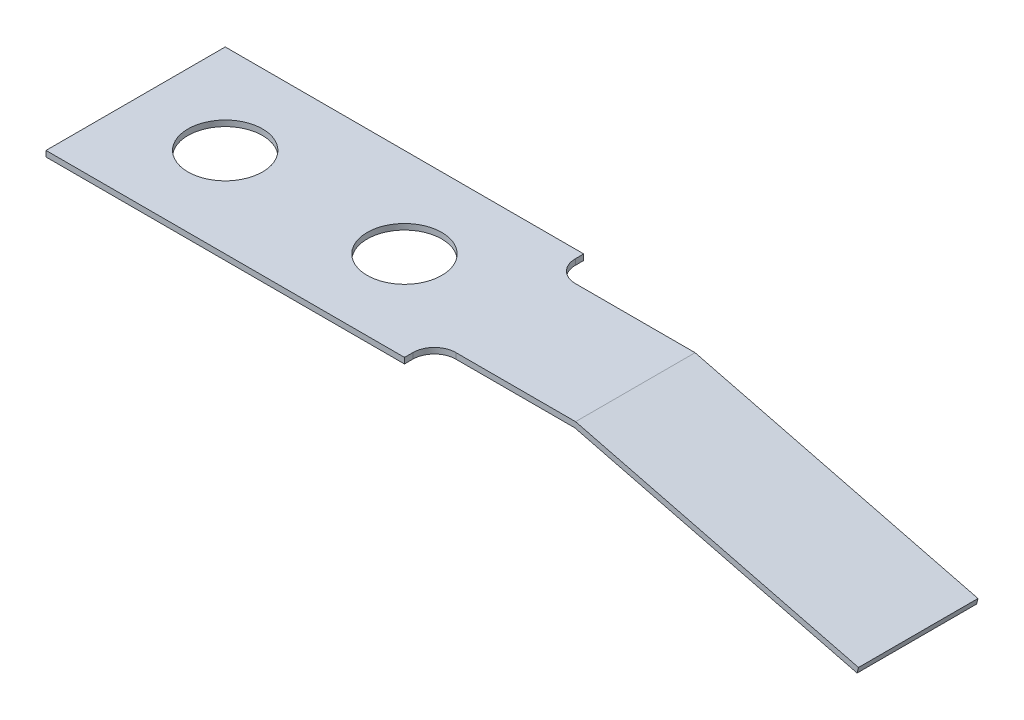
ISO-10303-21;
HEADER;
FILE_DESCRIPTION(('STEP AP214'),'2;1');
FILE_NAME('part.step','',(''),(''),'','','');
FILE_SCHEMA(('AUTOMOTIVE_DESIGN { 1 0 10303 214 1 1 1 1 }'));
ENDSEC;
DATA;
#1=APPLICATION_CONTEXT('core data for automotive mechanical design processes');
#2=APPLICATION_PROTOCOL_DEFINITION('international standard','automotive_design',2000,#1);
#3=PRODUCT_CONTEXT('',#1,'mechanical');
#4=PRODUCT('Part','Part','',(#3));
#5=PRODUCT_RELATED_PRODUCT_CATEGORY('part','',(#4));
#6=PRODUCT_DEFINITION_FORMATION('','',#4);
#7=PRODUCT_DEFINITION_CONTEXT('part definition',#1,'design');
#8=PRODUCT_DEFINITION('design','',#6,#7);
#9=PRODUCT_DEFINITION_SHAPE('','',#8);
#10=(LENGTH_UNIT() NAMED_UNIT(*) SI_UNIT(.MILLI.,.METRE.));
#11=(NAMED_UNIT(*) PLANE_ANGLE_UNIT() SI_UNIT($,.RADIAN.));
#12=(NAMED_UNIT(*) SI_UNIT($,.STERADIAN.) SOLID_ANGLE_UNIT());
#13=UNCERTAINTY_MEASURE_WITH_UNIT(LENGTH_MEASURE(1.E-05),#10,'distance_accuracy_value','');
#14=(GEOMETRIC_REPRESENTATION_CONTEXT(3) GLOBAL_UNCERTAINTY_ASSIGNED_CONTEXT((#13)) GLOBAL_UNIT_ASSIGNED_CONTEXT((#10,
#11,#12)) REPRESENTATION_CONTEXT('',''));
#15=CARTESIAN_POINT('',(0.,0.,0.));
#16=DIRECTION('',(0.,0.,1.));
#17=DIRECTION('',(1.,0.,0.));
#18=AXIS2_PLACEMENT_3D('',#15,#16,#17);
#19=CARTESIAN_POINT('',(9.525,0.3048,4.7625));
#20=DIRECTION('',(-1.,0.,0.));
#21=DIRECTION('',(0.,0.,1.));
#22=AXIS2_PLACEMENT_3D('',#19,#20,#21);
#23=PLANE('',#22);
#24=DIRECTION('',(0.,0.,-1.));
#25=VECTOR('',#24,1.);
#26=CARTESIAN_POINT('',(9.525,0.3048,4.7625));
#27=LINE('',#26,#25);
#28=CARTESIAN_POINT('',(9.525,0.3048,-4.318));
#29=VERTEX_POINT('',#28);
#30=CARTESIAN_POINT('',(9.525,0.3048,-4.7625));
#31=VERTEX_POINT('',#30);
#32=EDGE_CURVE('E175',#29,#31,#27,.T.);
#33=ORIENTED_EDGE('',*,*,#32,.F.);
#34=DIRECTION('',(0.,1.,0.));
#35=VECTOR('',#34,1.);
#36=CARTESIAN_POINT('',(9.525,0.3048,-4.318));
#37=LINE('',#36,#35);
#38=CARTESIAN_POINT('',(9.525,0.,-4.318));
#39=VERTEX_POINT('',#38);
#40=EDGE_CURVE('E216',#29,#39,#37,.F.);
#41=ORIENTED_EDGE('',*,*,#40,.T.);
#42=DIRECTION('',(0.,0.,-1.));
#43=VECTOR('',#42,1.);
#44=CARTESIAN_POINT('',(9.525,0.,4.7625));
#45=LINE('',#44,#43);
#46=CARTESIAN_POINT('',(9.525,0.,-4.7625));
#47=VERTEX_POINT('',#46);
#48=EDGE_CURVE('E166',#39,#47,#45,.T.);
#49=ORIENTED_EDGE('',*,*,#48,.T.);
#50=DIRECTION('',(0.,-1.,0.));
#51=VECTOR('',#50,1.);
#52=CARTESIAN_POINT('',(9.525,0.3048,-4.7625));
#53=LINE('',#52,#51);
#54=EDGE_CURVE('E217',#31,#47,#53,.T.);
#55=ORIENTED_EDGE('',*,*,#54,.F.);
#56=EDGE_LOOP('',(#33,#41,#49,#55));
#57=FACE_BOUND('',#56,.T.);
#58=ADVANCED_FACE('F35',(#57),#23,.F.);
#59=CARTESIAN_POINT('',(0.,0.3048,0.));
#60=DIRECTION('',(0.,-1.,0.));
#61=DIRECTION('',(0.,0.,-1.));
#62=AXIS2_PLACEMENT_3D('',#59,#60,#61);
#63=PLANE('',#62);
#64=CARTESIAN_POINT('',(-4.7625,0.3048,0.));
#65=DIRECTION('',(0.,1.,0.));
#66=DIRECTION('',(0.,0.,1.));
#67=AXIS2_PLACEMENT_3D('',#64,#65,#66);
#68=CIRCLE('',#67,1.9812);
#69=CARTESIAN_POINT('',(-4.7625,0.3048,1.9812));
#70=VERTEX_POINT('',#69);
#71=EDGE_CURVE('E163',#70,#70,#68,.T.);
#72=ORIENTED_EDGE('',*,*,#71,.F.);
#73=EDGE_LOOP('',(#72));
#74=FACE_BOUND('',#73,.T.);
#75=CARTESIAN_POINT('',(9.525,0.3048,4.7625));
#76=VERTEX_POINT('',#75);
#77=CARTESIAN_POINT('',(9.525,0.3048,4.318));
#78=VERTEX_POINT('',#77);
#79=EDGE_CURVE('E179',#76,#78,#27,.T.);
#80=ORIENTED_EDGE('',*,*,#79,.T.);
#81=CARTESIAN_POINT('',(10.668,0.3048,4.318));
#82=DIRECTION('',(0.,-1.,0.));
#83=DIRECTION('',(0.,0.,-1.));
#84=AXIS2_PLACEMENT_3D('',#81,#82,#83);
#85=CIRCLE('',#84,1.143);
#86=CARTESIAN_POINT('',(10.668,0.3048,3.175));
#87=VERTEX_POINT('',#86);
#88=EDGE_CURVE('E43',#78,#87,#85,.T.);
#89=ORIENTED_EDGE('',*,*,#88,.T.);
#90=DIRECTION('',(1.,0.,0.));
#91=VECTOR('',#90,1.);
#92=CARTESIAN_POINT('',(9.525,0.3048,3.175));
#93=LINE('',#92,#91);
#94=CARTESIAN_POINT('',(17.030462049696,0.3048,3.175));
#95=VERTEX_POINT('',#94);
#96=EDGE_CURVE('E120',#87,#95,#93,.T.);
#97=ORIENTED_EDGE('',*,*,#96,.T.);
#98=DIRECTION('',(0.,0.,-1.));
#99=VECTOR('',#98,1.);
#100=CARTESIAN_POINT('',(17.030462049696,0.3048,18.7929421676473));
#101=LINE('',#100,#99);
#102=CARTESIAN_POINT('',(17.030462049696,0.3048,-3.175));
#103=VERTEX_POINT('',#102);
#104=EDGE_CURVE('E126',#95,#103,#101,.T.);
#105=ORIENTED_EDGE('',*,*,#104,.T.);
#106=DIRECTION('',(-1.,0.,0.));
#107=VECTOR('',#106,1.);
#108=CARTESIAN_POINT('',(9.525,0.3048,-3.175));
#109=LINE('',#108,#107);
#110=CARTESIAN_POINT('',(10.668,0.3048,-3.175));
#111=VERTEX_POINT('',#110);
#112=EDGE_CURVE('E128',#103,#111,#109,.T.);
#113=ORIENTED_EDGE('',*,*,#112,.T.);
#114=CARTESIAN_POINT('',(10.668,0.3048,-4.318));
#115=DIRECTION('',(0.,-1.,0.));
#116=DIRECTION('',(0.,0.,-1.));
#117=AXIS2_PLACEMENT_3D('',#114,#115,#116);
#118=CIRCLE('',#117,1.143);
#119=EDGE_CURVE('E194',#111,#29,#118,.T.);
#120=ORIENTED_EDGE('',*,*,#119,.T.);
#121=ORIENTED_EDGE('',*,*,#32,.T.);
#122=DIRECTION('',(-1.,0.,0.));
#123=VECTOR('',#122,1.);
#124=CARTESIAN_POINT('',(-9.525,0.3048,-4.7625));
#125=LINE('',#124,#123);
#126=CARTESIAN_POINT('',(-9.525,0.3048,-4.7625));
#127=VERTEX_POINT('',#126);
#128=EDGE_CURVE('E171',#31,#127,#125,.T.);
#129=ORIENTED_EDGE('',*,*,#128,.T.);
#130=DIRECTION('',(0.,0.,1.));
#131=VECTOR('',#130,1.);
#132=CARTESIAN_POINT('',(-9.525,0.3048,4.7625));
#133=LINE('',#132,#131);
#134=CARTESIAN_POINT('',(-9.525,0.3048,4.7625));
#135=VERTEX_POINT('',#134);
#136=EDGE_CURVE('E248',#127,#135,#133,.T.);
#137=ORIENTED_EDGE('',*,*,#136,.T.);
#138=DIRECTION('',(1.,0.,0.));
#139=VECTOR('',#138,1.);
#140=CARTESIAN_POINT('',(-9.525,0.3048,4.7625));
#141=LINE('',#140,#139);
#142=EDGE_CURVE('E227',#135,#76,#141,.T.);
#143=ORIENTED_EDGE('',*,*,#142,.T.);
#144=EDGE_LOOP('',(#80,#89,#97,#105,#113,#120,#121,#129,#137,#143));
#145=FACE_BOUND('',#144,.T.);
#146=CARTESIAN_POINT('',(4.7625,0.3048,0.));
#147=DIRECTION('',(0.,1.,0.));
#148=DIRECTION('',(0.,0.,-1.));
#149=AXIS2_PLACEMENT_3D('',#146,#147,#148);
#150=CIRCLE('',#149,1.9812);
#151=CARTESIAN_POINT('',(4.7625,0.3048,-1.9812));
#152=VERTEX_POINT('',#151);
#153=EDGE_CURVE('E156',#152,#152,#150,.T.);
#154=ORIENTED_EDGE('',*,*,#153,.F.);
#155=EDGE_LOOP('',(#154));
#156=FACE_BOUND('',#155,.T.);
#157=ADVANCED_FACE('F122',(#74,#145,#156),#63,.F.);
#158=CARTESIAN_POINT('',(0.,0.,0.));
#159=DIRECTION('',(0.,-1.,0.));
#160=DIRECTION('',(0.,0.,-1.));
#161=AXIS2_PLACEMENT_3D('',#158,#159,#160);
#162=PLANE('',#161);
#163=CARTESIAN_POINT('',(-4.7625,0.,0.));
#164=DIRECTION('',(0.,1.,0.));
#165=DIRECTION('',(0.,0.,1.));
#166=AXIS2_PLACEMENT_3D('',#163,#164,#165);
#167=CIRCLE('',#166,1.9812);
#168=CARTESIAN_POINT('',(-4.7625,0.,1.9812));
#169=VERTEX_POINT('',#168);
#170=EDGE_CURVE('E159',#169,#169,#167,.T.);
#171=ORIENTED_EDGE('',*,*,#170,.T.);
#172=EDGE_LOOP('',(#171));
#173=FACE_BOUND('',#172,.T.);
#174=CARTESIAN_POINT('',(9.525,0.,4.7625));
#175=VERTEX_POINT('',#174);
#176=CARTESIAN_POINT('',(9.525,0.,4.318));
#177=VERTEX_POINT('',#176);
#178=EDGE_CURVE('E182',#175,#177,#45,.T.);
#179=ORIENTED_EDGE('',*,*,#178,.F.);
#180=DIRECTION('',(1.,0.,0.));
#181=VECTOR('',#180,1.);
#182=CARTESIAN_POINT('',(-9.525,0.,4.7625));
#183=LINE('',#182,#181);
#184=CARTESIAN_POINT('',(-9.525,0.,4.7625));
#185=VERTEX_POINT('',#184);
#186=EDGE_CURVE('E233',#185,#175,#183,.T.);
#187=ORIENTED_EDGE('',*,*,#186,.F.);
#188=DIRECTION('',(0.,0.,1.));
#189=VECTOR('',#188,1.);
#190=CARTESIAN_POINT('',(-9.525,0.,4.7625));
#191=LINE('',#190,#189);
#192=CARTESIAN_POINT('',(-9.525,0.,-4.7625));
#193=VERTEX_POINT('',#192);
#194=EDGE_CURVE('E231',#193,#185,#191,.T.);
#195=ORIENTED_EDGE('',*,*,#194,.F.);
#196=DIRECTION('',(-1.,0.,0.));
#197=VECTOR('',#196,1.);
#198=CARTESIAN_POINT('',(-9.525,0.,-4.7625));
#199=LINE('',#198,#197);
#200=EDGE_CURVE('E228',#47,#193,#199,.T.);
#201=ORIENTED_EDGE('',*,*,#200,.F.);
#202=ORIENTED_EDGE('',*,*,#48,.F.);
#203=CARTESIAN_POINT('',(10.668,0.,-4.318));
#204=DIRECTION('',(0.,-1.,0.));
#205=DIRECTION('',(0.,0.,-1.));
#206=AXIS2_PLACEMENT_3D('',#203,#204,#205);
#207=CIRCLE('',#206,1.143);
#208=CARTESIAN_POINT('',(10.668,0.,-3.175));
#209=VERTEX_POINT('',#208);
#210=EDGE_CURVE('E196',#39,#209,#207,.F.);
#211=ORIENTED_EDGE('',*,*,#210,.T.);
#212=DIRECTION('',(-1.,0.,0.));
#213=VECTOR('',#212,1.);
#214=CARTESIAN_POINT('',(9.525,0.,-3.175));
#215=LINE('',#214,#213);
#216=CARTESIAN_POINT('',(16.9926,0.,-3.175));
#217=VERTEX_POINT('',#216);
#218=EDGE_CURVE('E154',#217,#209,#215,.T.);
#219=ORIENTED_EDGE('',*,*,#218,.F.);
#220=DIRECTION('',(0.,0.,-1.));
#221=VECTOR('',#220,1.);
#222=CARTESIAN_POINT('',(16.9926,0.,-3.175));
#223=LINE('',#222,#221);
#224=CARTESIAN_POINT('',(16.9926,0.,3.175));
#225=VERTEX_POINT('',#224);
#226=EDGE_CURVE('E151',#225,#217,#223,.T.);
#227=ORIENTED_EDGE('',*,*,#226,.F.);
#228=DIRECTION('',(1.,0.,0.));
#229=VECTOR('',#228,1.);
#230=CARTESIAN_POINT('',(9.525,0.,3.175));
#231=LINE('',#230,#229);
#232=CARTESIAN_POINT('',(10.668,0.,3.175));
#233=VERTEX_POINT('',#232);
#234=EDGE_CURVE('E155',#233,#225,#231,.T.);
#235=ORIENTED_EDGE('',*,*,#234,.F.);
#236=CARTESIAN_POINT('',(10.668,0.,4.318));
#237=DIRECTION('',(0.,-1.,0.));
#238=DIRECTION('',(0.,0.,-1.));
#239=AXIS2_PLACEMENT_3D('',#236,#237,#238);
#240=CIRCLE('',#239,1.143);
#241=EDGE_CURVE('E11',#233,#177,#240,.F.);
#242=ORIENTED_EDGE('',*,*,#241,.T.);
#243=EDGE_LOOP('',(#179,#187,#195,#201,#202,#211,#219,#227,#235,#242));
#244=FACE_BOUND('',#243,.T.);
#245=CARTESIAN_POINT('',(4.7625,0.,0.));
#246=DIRECTION('',(0.,1.,0.));
#247=DIRECTION('',(0.,0.,-1.));
#248=AXIS2_PLACEMENT_3D('',#245,#246,#247);
#249=CIRCLE('',#248,1.9812);
#250=CARTESIAN_POINT('',(4.7625,0.,-1.9812));
#251=VERTEX_POINT('',#250);
#252=EDGE_CURVE('E160',#251,#251,#249,.T.);
#253=ORIENTED_EDGE('',*,*,#252,.T.);
#254=EDGE_LOOP('',(#253));
#255=FACE_BOUND('',#254,.T.);
#256=ADVANCED_FACE('F202',(#173,#244,#255),#162,.T.);
#257=ORIENTED_EDGE('',*,*,#178,.T.);
#258=DIRECTION('',(0.,1.,0.));
#259=VECTOR('',#258,1.);
#260=CARTESIAN_POINT('',(9.525,0.3048,4.318));
#261=LINE('',#260,#259);
#262=EDGE_CURVE('E191',#177,#78,#261,.T.);
#263=ORIENTED_EDGE('',*,*,#262,.T.);
#264=ORIENTED_EDGE('',*,*,#79,.F.);
#265=DIRECTION('',(0.,-1.,0.));
#266=VECTOR('',#265,1.);
#267=CARTESIAN_POINT('',(9.525,0.3048,4.7625));
#268=LINE('',#267,#266);
#269=EDGE_CURVE('E235',#76,#175,#268,.T.);
#270=ORIENTED_EDGE('',*,*,#269,.T.);
#271=EDGE_LOOP('',(#257,#263,#264,#270));
#272=FACE_BOUND('',#271,.T.);
#273=ADVANCED_FACE('F259',(#272),#23,.F.);
#274=CARTESIAN_POINT('',(-9.525,0.3048,-4.7625));
#275=DIRECTION('',(0.,0.,1.));
#276=DIRECTION('',(1.,0.,0.));
#277=AXIS2_PLACEMENT_3D('',#274,#275,#276);
#278=PLANE('',#277);
#279=ORIENTED_EDGE('',*,*,#200,.T.);
#280=DIRECTION('',(0.,-1.,0.));
#281=VECTOR('',#280,1.);
#282=CARTESIAN_POINT('',(-9.525,0.3048,-4.7625));
#283=LINE('',#282,#281);
#284=EDGE_CURVE('E220',#127,#193,#283,.T.);
#285=ORIENTED_EDGE('',*,*,#284,.F.);
#286=ORIENTED_EDGE('',*,*,#128,.F.);
#287=ORIENTED_EDGE('',*,*,#54,.T.);
#288=EDGE_LOOP('',(#279,#285,#286,#287));
#289=FACE_BOUND('',#288,.T.);
#290=ADVANCED_FACE('F264',(#289),#278,.F.);
#291=CARTESIAN_POINT('',(-9.525,0.3048,4.7625));
#292=DIRECTION('',(1.,0.,0.));
#293=DIRECTION('',(0.,0.,-1.));
#294=AXIS2_PLACEMENT_3D('',#291,#292,#293);
#295=PLANE('',#294);
#296=ORIENTED_EDGE('',*,*,#194,.T.);
#297=DIRECTION('',(0.,-1.,0.));
#298=VECTOR('',#297,1.);
#299=CARTESIAN_POINT('',(-9.525,0.3048,4.7625));
#300=LINE('',#299,#298);
#301=EDGE_CURVE('E238',#135,#185,#300,.T.);
#302=ORIENTED_EDGE('',*,*,#301,.F.);
#303=ORIENTED_EDGE('',*,*,#136,.F.);
#304=ORIENTED_EDGE('',*,*,#284,.T.);
#305=EDGE_LOOP('',(#296,#302,#303,#304));
#306=FACE_BOUND('',#305,.T.);
#307=ADVANCED_FACE('F246',(#306),#295,.F.);
#308=CARTESIAN_POINT('',(-9.525,0.3048,4.7625));
#309=DIRECTION('',(0.,0.,-1.));
#310=DIRECTION('',(-1.,0.,0.));
#311=AXIS2_PLACEMENT_3D('',#308,#309,#310);
#312=PLANE('',#311);
#313=ORIENTED_EDGE('',*,*,#186,.T.);
#314=ORIENTED_EDGE('',*,*,#269,.F.);
#315=ORIENTED_EDGE('',*,*,#142,.F.);
#316=ORIENTED_EDGE('',*,*,#301,.T.);
#317=EDGE_LOOP('',(#313,#314,#315,#316));
#318=FACE_BOUND('',#317,.T.);
#319=ADVANCED_FACE('F255',(#318),#312,.F.);
#320=CARTESIAN_POINT('',(-4.7625,0.3048,0.));
#321=DIRECTION('',(0.,-1.,0.));
#322=DIRECTION('',(0.,0.,-1.));
#323=AXIS2_PLACEMENT_3D('',#320,#321,#322);
#324=CYLINDRICAL_SURFACE('',#323,1.9812);
#325=ORIENTED_EDGE('',*,*,#71,.T.);
#326=EDGE_LOOP('',(#325));
#327=FACE_BOUND('',#326,.T.);
#328=ORIENTED_EDGE('',*,*,#170,.F.);
#329=EDGE_LOOP('',(#328));
#330=FACE_BOUND('',#329,.T.);
#331=ADVANCED_FACE('F287',(#327,#330),#324,.F.);
#332=CARTESIAN_POINT('',(4.7625,0.3048,0.));
#333=DIRECTION('',(0.,-1.,0.));
#334=DIRECTION('',(0.,0.,-1.));
#335=AXIS2_PLACEMENT_3D('',#332,#333,#334);
#336=CYLINDRICAL_SURFACE('',#335,1.9812);
#337=ORIENTED_EDGE('',*,*,#153,.T.);
#338=EDGE_LOOP('',(#337));
#339=FACE_BOUND('',#338,.T.);
#340=ORIENTED_EDGE('',*,*,#252,.F.);
#341=EDGE_LOOP('',(#340));
#342=FACE_BOUND('',#341,.T.);
#343=ADVANCED_FACE('F303',(#339,#342),#336,.F.);
#344=CARTESIAN_POINT('',(9.525,0.,-3.175));
#345=DIRECTION('',(0.,0.,-1.));
#346=DIRECTION('',(-1.,0.,0.));
#347=AXIS2_PLACEMENT_3D('',#344,#345,#346);
#348=PLANE('',#347);
#349=ORIENTED_EDGE('',*,*,#218,.T.);
#350=DIRECTION('',(0.,1.,0.));
#351=VECTOR('',#350,1.);
#352=CARTESIAN_POINT('',(10.668,0.,-3.175));
#353=LINE('',#352,#351);
#354=EDGE_CURVE('E212',#209,#111,#353,.T.);
#355=ORIENTED_EDGE('',*,*,#354,.T.);
#356=ORIENTED_EDGE('',*,*,#112,.F.);
#357=DIRECTION('',(0.969608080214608,-0.244663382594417,0.));
#358=VECTOR('',#357,1.);
#359=CARTESIAN_POINT('',(17.030462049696,0.3048,-3.175));
#360=LINE('',#359,#358);
#361=CARTESIAN_POINT('',(32.0656529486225,-3.48906345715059,-3.175));
#362=VERTEX_POINT('',#361);
#363=EDGE_CURVE('E142',#103,#362,#360,.T.);
#364=ORIENTED_EDGE('',*,*,#363,.T.);
#365=DIRECTION('',(-0.244663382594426,-0.969608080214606,0.));
#366=VECTOR('',#365,1.);
#367=CARTESIAN_POINT('',(32.0656529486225,-3.48906345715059,-3.175));
#368=LINE('',#367,#366);
#369=CARTESIAN_POINT('',(31.9910795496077,-3.7846,-3.175));
#370=VERTEX_POINT('',#369);
#371=EDGE_CURVE('E146',#362,#370,#368,.T.);
#372=ORIENTED_EDGE('',*,*,#371,.T.);
#373=DIRECTION('',(-0.969608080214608,0.244663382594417,0.));
#374=VECTOR('',#373,1.);
#375=CARTESIAN_POINT('',(16.9926,0.,-3.175));
#376=LINE('',#375,#374);
#377=EDGE_CURVE('E143',#370,#217,#376,.T.);
#378=ORIENTED_EDGE('',*,*,#377,.T.);
#379=EDGE_LOOP('',(#349,#355,#356,#364,#372,#378));
#380=FACE_BOUND('',#379,.T.);
#381=ADVANCED_FACE('F211',(#380),#348,.T.);
#382=CARTESIAN_POINT('',(9.525,0.,3.175));
#383=DIRECTION('',(0.,0.,1.));
#384=DIRECTION('',(1.,0.,0.));
#385=AXIS2_PLACEMENT_3D('',#382,#383,#384);
#386=PLANE('',#385);
#387=ORIENTED_EDGE('',*,*,#96,.F.);
#388=DIRECTION('',(0.,1.,0.));
#389=VECTOR('',#388,1.);
#390=CARTESIAN_POINT('',(10.668,0.,3.175));
#391=LINE('',#390,#389);
#392=EDGE_CURVE('E50',#87,#233,#391,.F.);
#393=ORIENTED_EDGE('',*,*,#392,.T.);
#394=ORIENTED_EDGE('',*,*,#234,.T.);
#395=DIRECTION('',(-0.969608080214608,0.244663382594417,0.));
#396=VECTOR('',#395,1.);
#397=CARTESIAN_POINT('',(16.9926,0.,3.175));
#398=LINE('',#397,#396);
#399=CARTESIAN_POINT('',(31.9910795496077,-3.7846,3.175));
#400=VERTEX_POINT('',#399);
#401=EDGE_CURVE('E129',#400,#225,#398,.T.);
#402=ORIENTED_EDGE('',*,*,#401,.F.);
#403=DIRECTION('',(-0.244663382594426,-0.969608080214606,0.));
#404=VECTOR('',#403,1.);
#405=CARTESIAN_POINT('',(32.0656529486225,-3.48906345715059,3.175));
#406=LINE('',#405,#404);
#407=CARTESIAN_POINT('',(32.0656529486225,-3.48906345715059,3.175));
#408=VERTEX_POINT('',#407);
#409=EDGE_CURVE('E135',#408,#400,#406,.T.);
#410=ORIENTED_EDGE('',*,*,#409,.F.);
#411=DIRECTION('',(0.969608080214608,-0.244663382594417,0.));
#412=VECTOR('',#411,1.);
#413=CARTESIAN_POINT('',(17.030462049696,0.3048,3.175));
#414=LINE('',#413,#412);
#415=EDGE_CURVE('E132',#95,#408,#414,.T.);
#416=ORIENTED_EDGE('',*,*,#415,.F.);
#417=EDGE_LOOP('',(#387,#393,#394,#402,#410,#416));
#418=FACE_BOUND('',#417,.T.);
#419=ADVANCED_FACE('F133',(#418),#386,.T.);
#420=CARTESIAN_POINT('',(10.668,0.,-4.318));
#421=DIRECTION('',(0.,1.,0.));
#422=DIRECTION('',(0.,0.,1.));
#423=AXIS2_PLACEMENT_3D('',#420,#421,#422);
#424=CYLINDRICAL_SURFACE('',#423,1.143);
#425=ORIENTED_EDGE('',*,*,#210,.F.);
#426=ORIENTED_EDGE('',*,*,#40,.F.);
#427=ORIENTED_EDGE('',*,*,#119,.F.);
#428=ORIENTED_EDGE('',*,*,#354,.F.);
#429=EDGE_LOOP('',(#425,#426,#427,#428));
#430=FACE_BOUND('',#429,.T.);
#431=ADVANCED_FACE('F215',(#430),#424,.F.);
#432=CARTESIAN_POINT('',(10.668,0.3048,4.318));
#433=DIRECTION('',(0.,1.,0.));
#434=DIRECTION('',(0.,0.,1.));
#435=AXIS2_PLACEMENT_3D('',#432,#433,#434);
#436=CYLINDRICAL_SURFACE('',#435,1.143);
#437=ORIENTED_EDGE('',*,*,#241,.F.);
#438=ORIENTED_EDGE('',*,*,#392,.F.);
#439=ORIENTED_EDGE('',*,*,#88,.F.);
#440=ORIENTED_EDGE('',*,*,#262,.F.);
#441=EDGE_LOOP('',(#437,#438,#439,#440));
#442=FACE_BOUND('',#441,.T.);
#443=ADVANCED_FACE('F37',(#442),#436,.F.);
#444=CARTESIAN_POINT('',(17.030462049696,0.3048,18.7929421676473));
#445=DIRECTION('',(0.244663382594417,0.969608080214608,0.));
#446=DIRECTION('',(-0.969608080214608,0.244663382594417,0.));
#447=AXIS2_PLACEMENT_3D('',#444,#445,#446);
#448=PLANE('',#447);
#449=ORIENTED_EDGE('',*,*,#104,.F.);
#450=ORIENTED_EDGE('',*,*,#415,.T.);
#451=DIRECTION('',(0.,0.,-1.));
#452=VECTOR('',#451,1.);
#453=CARTESIAN_POINT('',(32.0656529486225,-3.48906345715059,18.7929421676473));
#454=LINE('',#453,#452);
#455=EDGE_CURVE('E138',#408,#362,#454,.T.);
#456=ORIENTED_EDGE('',*,*,#455,.T.);
#457=ORIENTED_EDGE('',*,*,#363,.F.);
#458=EDGE_LOOP('',(#449,#450,#456,#457));
#459=FACE_BOUND('',#458,.T.);
#460=ADVANCED_FACE('F140',(#459),#448,.T.);
#461=CARTESIAN_POINT('',(32.0656529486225,-3.48906345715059,18.7929421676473));
#462=DIRECTION('',(0.969608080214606,-0.244663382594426,0.));
#463=DIRECTION('',(0.244663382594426,0.969608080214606,0.));
#464=AXIS2_PLACEMENT_3D('',#461,#462,#463);
#465=PLANE('',#464);
#466=ORIENTED_EDGE('',*,*,#455,.F.);
#467=ORIENTED_EDGE('',*,*,#409,.T.);
#468=DIRECTION('',(0.,0.,-1.));
#469=VECTOR('',#468,1.);
#470=CARTESIAN_POINT('',(31.9910795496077,-3.7846,18.7929421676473));
#471=LINE('',#470,#469);
#472=EDGE_CURVE('E419',#400,#370,#471,.T.);
#473=ORIENTED_EDGE('',*,*,#472,.T.);
#474=ORIENTED_EDGE('',*,*,#371,.F.);
#475=EDGE_LOOP('',(#466,#467,#473,#474));
#476=FACE_BOUND('',#475,.T.);
#477=ADVANCED_FACE('F341',(#476),#465,.T.);
#478=CARTESIAN_POINT('',(16.9926,0.,18.7929421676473));
#479=DIRECTION('',(-0.244663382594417,-0.969608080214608,0.));
#480=DIRECTION('',(0.969608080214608,-0.244663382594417,0.));
#481=AXIS2_PLACEMENT_3D('',#478,#479,#480);
#482=PLANE('',#481);
#483=ORIENTED_EDGE('',*,*,#472,.F.);
#484=ORIENTED_EDGE('',*,*,#401,.T.);
#485=ORIENTED_EDGE('',*,*,#226,.T.);
#486=ORIENTED_EDGE('',*,*,#377,.F.);
#487=EDGE_LOOP('',(#483,#484,#485,#486));
#488=FACE_BOUND('',#487,.T.);
#489=ADVANCED_FACE('F348',(#488),#482,.T.);
#490=CLOSED_SHELL('',(#58,#157,#256,#273,#290,#307,#319,#331,#343,#381,#419,#431,#443,#460,#477,#489));
#491=MANIFOLD_SOLID_BREP('B2',#490);
#492=ADVANCED_BREP_SHAPE_REPRESENTATION('',(#18,#491),#14);
#493=SHAPE_DEFINITION_REPRESENTATION(#9,#492);
ENDSEC;
END-ISO-10303-21;
